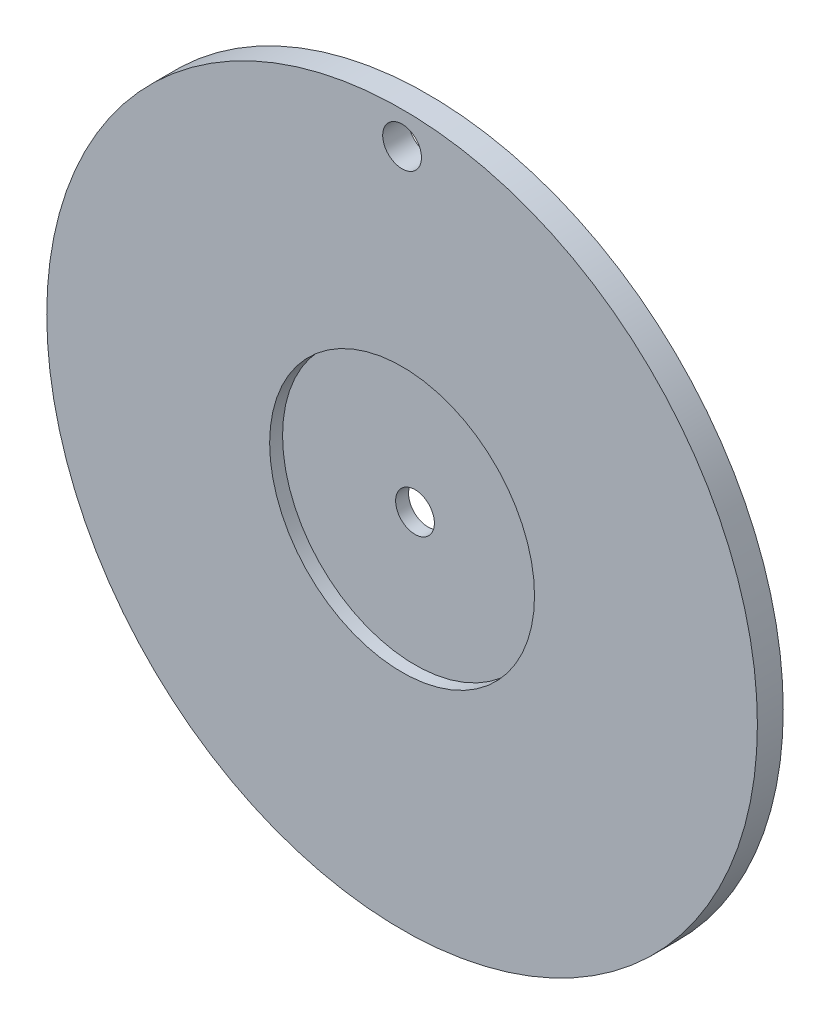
from build123d import *

# Parameters (mm, degrees)
SKIZZE1_R                       = 27.5
SKIZZE1_R_2                     = 1.5
AUFSATZ_LINEAR_AUSTRAGEN2_DEPTH = 2
SKIZZE3_R                       = 10.25
SCHNITT_LINEAR_AUSTRAGEN1_DEPTH = 1
SKIZZE5_R                       = 1.5
SCHNITT_LINEAR_AUSTRAGEN2_DEPTH = 9


with BuildPart() as part:
    # Skizze1 → Aufsatz-Linear austragen2 (new body)
    with BuildSketch(Plane.XY):
        Circle(SKIZZE1_R)
        with Locations((0, 25)):
            Circle(SKIZZE1_R_2, mode=Mode.SUBTRACT)
    extrude(amount=AUFSATZ_LINEAR_AUSTRAGEN2_DEPTH)

    # Skizze3 → Schnitt-Linear austragen1 (cut)
    with BuildSketch(Plane.XY.offset(2)):
        Circle(SKIZZE3_R)
    extrude(amount=-SCHNITT_LINEAR_AUSTRAGEN1_DEPTH, mode=Mode.SUBTRACT)

    # Skizze5 → Schnitt-Linear austragen2 (cut)
    with BuildSketch(Plane.XY.offset(1)):
        Circle(SKIZZE5_R)
    extrude(amount=-SCHNITT_LINEAR_AUSTRAGEN2_DEPTH, mode=Mode.SUBTRACT)


solid = part.part
